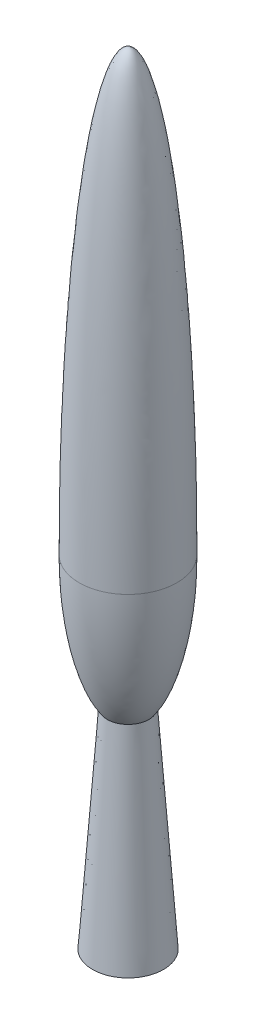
from build123d import *

# Parameters (mm, degrees)
ESQUISSE1_R        = 1000
BOSS_EXTRU_1_DEPTH = 0.01
D_ME1_FACE_RADIUS  = 1000
D_ME1_HEIGHT       = 9000
D_ME2_FACE_RADIUS  = 1000
D_ME2_HEIGHT       = 3000
ESQUISSE2_R        = 237.86
BOSS_EXTRU_2_DEPTH = 7000
BOSS_EXTRU_2_DRAFT = 4


with BuildPart() as part:
    # Esquisse1 → Boss.-Extru.1 (new body)
    with BuildSketch(Plane(origin=(0, 0, 0), x_dir=(1, 0, 0), z_dir=(0, 1, 0))):
        with Locations(Location((0, 0, 0), (0, 0, 90))):
            Circle(ESQUISSE1_R)
    extrude(amount=BOSS_EXTRU_1_DEPTH)

    # D_me1: an elliptical dome of height H over a round flat face of radius A is half a spheroid: the quarter ellipse of half axes A and H revolved about the face's axis
    with BuildSketch(Plane((0, 0.01, 0), x_dir=(0, 0, -1), z_dir=(1, 0, 0)), mode=Mode.PRIVATE) as d_me1_quarter:
        Ellipse(D_ME1_FACE_RADIUS, D_ME1_HEIGHT)
        Rectangle(D_ME1_FACE_RADIUS, D_ME1_HEIGHT, align=(Align.MIN, Align.MIN), mode=Mode.INTERSECT)
    revolve(d_me1_quarter.sketch, axis=Axis((0, 0.01, 0), (0, 1, 0)))

    # D_me2: an elliptical dome of height H over a round flat face of radius A is half a spheroid: the quarter ellipse of half axes A and H revolved about the face's axis
    with BuildSketch(Plane((0, 0, 0), x_dir=(0, 0, 1), z_dir=(1, 0, 0)), mode=Mode.PRIVATE) as d_me2_quarter:
        Ellipse(D_ME2_FACE_RADIUS, D_ME2_HEIGHT)
        Rectangle(D_ME2_FACE_RADIUS, D_ME2_HEIGHT, align=(Align.MIN, Align.MIN), mode=Mode.INTERSECT)
    revolve(d_me2_quarter.sketch, axis=Axis((0, 0, 0), (0, -1, 0)))


with BuildPart() as boss_extru_2_tool:
    # Esquisse2 → Boss.-Extru.2 (with draft: the straight prism first)
    with BuildSketch(Plane(origin=(0, 0, 0), x_dir=(1, 0, 0), z_dir=(0, 1, 0))):
        Circle(ESQUISSE2_R)
    extrude(amount=-BOSS_EXTRU_2_DEPTH)
    # Boss.-Extru.2: the draft: its side faces are tilted about the plane it starts from
    boss_extru_2_sides = [boss_extru_2_tool.faces().sort_by_distance(p)[0] for p in [
        (-237.86, -3500, 0),
    ]]
    draft(boss_extru_2_sides, Plane(origin=(0, 0, 0), x_dir=(1, 0, 0), z_dir=(0, 1, 0)), BOSS_EXTRU_2_DRAFT)


with BuildPart() as part_1:
    add(part.part)

    # Boss.-Extru.2: add boss_extru_2_tool
    add(boss_extru_2_tool.part)


solid = part_1.part
